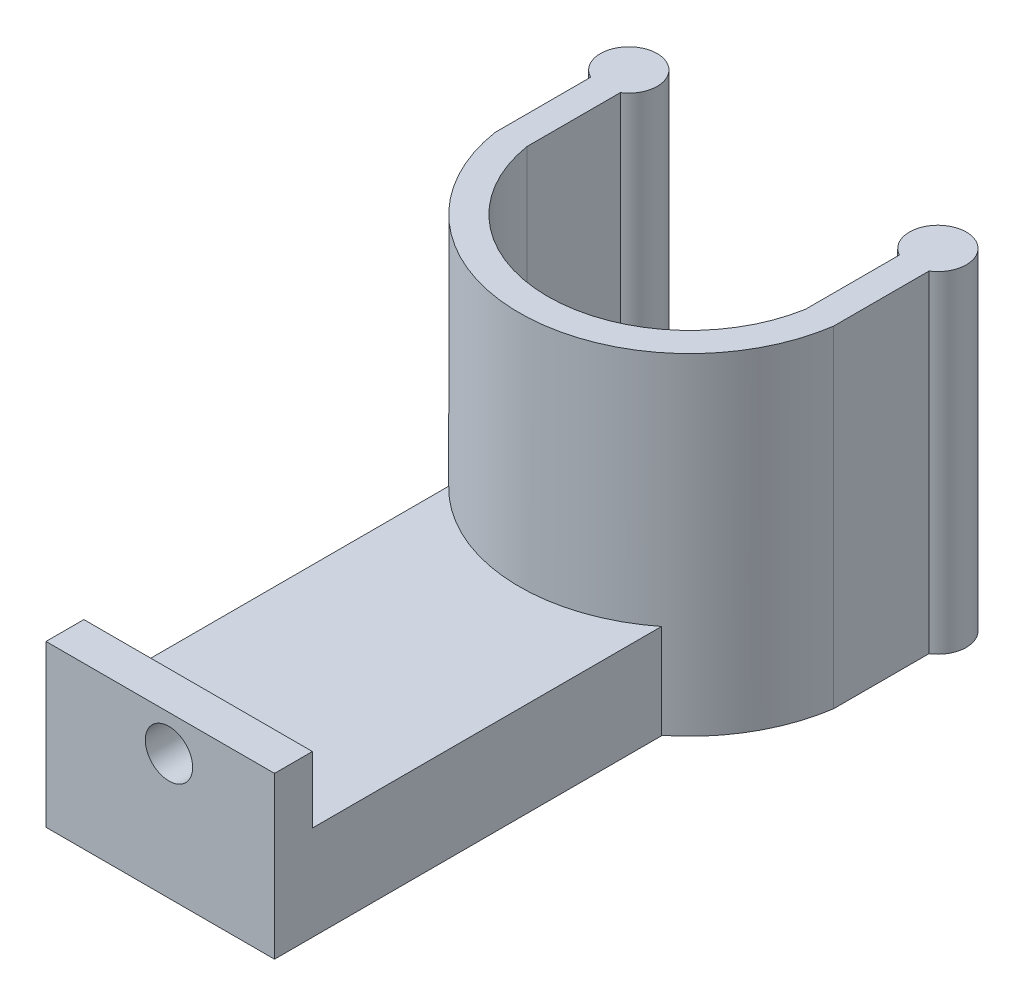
ISO-10303-21;
HEADER;
FILE_DESCRIPTION(('STEP AP214'),'2;1');
FILE_NAME('part.step','',(''),(''),'','','');
FILE_SCHEMA(('AUTOMOTIVE_DESIGN { 1 0 10303 214 1 1 1 1 }'));
ENDSEC;
DATA;
#1=APPLICATION_CONTEXT('core data for automotive mechanical design processes');
#2=APPLICATION_PROTOCOL_DEFINITION('international standard','automotive_design',2000,#1);
#3=PRODUCT_CONTEXT('',#1,'mechanical');
#4=PRODUCT('Part','Part','',(#3));
#5=PRODUCT_RELATED_PRODUCT_CATEGORY('part','',(#4));
#6=PRODUCT_DEFINITION_FORMATION('','',#4);
#7=PRODUCT_DEFINITION_CONTEXT('part definition',#1,'design');
#8=PRODUCT_DEFINITION('design','',#6,#7);
#9=PRODUCT_DEFINITION_SHAPE('','',#8);
#10=(LENGTH_UNIT() NAMED_UNIT(*) SI_UNIT(.MILLI.,.METRE.));
#11=(NAMED_UNIT(*) PLANE_ANGLE_UNIT() SI_UNIT($,.RADIAN.));
#12=(NAMED_UNIT(*) SI_UNIT($,.STERADIAN.) SOLID_ANGLE_UNIT());
#13=UNCERTAINTY_MEASURE_WITH_UNIT(LENGTH_MEASURE(1.E-05),#10,'distance_accuracy_value','');
#14=(GEOMETRIC_REPRESENTATION_CONTEXT(3) GLOBAL_UNCERTAINTY_ASSIGNED_CONTEXT((#13)) GLOBAL_UNIT_ASSIGNED_CONTEXT((#10,
#11,#12)) REPRESENTATION_CONTEXT('',''));
#15=CARTESIAN_POINT('',(0.,0.,0.));
#16=DIRECTION('',(0.,0.,1.));
#17=DIRECTION('',(1.,0.,0.));
#18=AXIS2_PLACEMENT_3D('',#15,#16,#17);
#19=CARTESIAN_POINT('',(16.2064052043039,35.,-10.0002773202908));
#20=DIRECTION('',(0.,-1.,0.));
#21=DIRECTION('',(0.,0.,-1.));
#22=AXIS2_PLACEMENT_3D('',#19,#20,#21);
#23=CYLINDRICAL_SURFACE('',#22,3.);
#24=CARTESIAN_POINT('',(16.2064052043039,0.,-10.0002773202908));
#25=DIRECTION('',(0.,1.,0.));
#26=DIRECTION('',(0.,0.,1.));
#27=AXIS2_PLACEMENT_3D('',#24,#25,#26);
#28=CIRCLE('',#27,3.);
#29=CARTESIAN_POINT('',(17.8074399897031,0.,-7.46321452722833));
#30=VERTEX_POINT('',#29);
#31=CARTESIAN_POINT('',(14.7811398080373,0.,-7.36046320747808));
#32=VERTEX_POINT('',#31);
#33=EDGE_CURVE('E234',#30,#32,#28,.T.);
#34=ORIENTED_EDGE('',*,*,#33,.T.);
#35=DIRECTION('',(0.,-1.,0.));
#36=VECTOR('',#35,1.);
#37=CARTESIAN_POINT('',(14.7811398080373,35.,-7.36046320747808));
#38=LINE('',#37,#36);
#39=CARTESIAN_POINT('',(14.7811398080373,35.,-7.36046320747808));
#40=VERTEX_POINT('',#39);
#41=EDGE_CURVE('E11',#40,#32,#38,.T.);
#42=ORIENTED_EDGE('',*,*,#41,.F.);
#43=CARTESIAN_POINT('',(16.2064052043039,35.,-10.0002773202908));
#44=DIRECTION('',(0.,1.,0.));
#45=DIRECTION('',(0.,0.,1.));
#46=AXIS2_PLACEMENT_3D('',#43,#44,#45);
#47=CIRCLE('',#46,3.);
#48=CARTESIAN_POINT('',(17.8074399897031,35.,-7.46321452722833));
#49=VERTEX_POINT('',#48);
#50=EDGE_CURVE('E253',#49,#40,#47,.T.);
#51=ORIENTED_EDGE('',*,*,#50,.F.);
#52=DIRECTION('',(0.,-1.,0.));
#53=VECTOR('',#52,1.);
#54=CARTESIAN_POINT('',(17.8074399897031,35.,-7.46321452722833));
#55=LINE('',#54,#53);
#56=EDGE_CURVE('E270',#49,#30,#55,.T.);
#57=ORIENTED_EDGE('',*,*,#56,.T.);
#58=EDGE_LOOP('',(#34,#42,#51,#57));
#59=FACE_BOUND('',#58,.T.);
#60=ADVANCED_FACE('F33',(#59),#23,.T.);
#61=CARTESIAN_POINT('',(14.7811398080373,35.,2.55301899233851));
#62=DIRECTION('',(1.,0.,0.));
#63=DIRECTION('',(0.,0.,-1.));
#64=AXIS2_PLACEMENT_3D('',#61,#62,#63);
#65=PLANE('',#64);
#66=DIRECTION('',(0.,0.,1.));
#67=VECTOR('',#66,1.);
#68=CARTESIAN_POINT('',(14.7811398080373,0.,2.55301899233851));
#69=LINE('',#68,#67);
#70=CARTESIAN_POINT('',(14.7811398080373,0.,2.55301899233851));
#71=VERTEX_POINT('',#70);
#72=EDGE_CURVE('E239',#32,#71,#69,.T.);
#73=ORIENTED_EDGE('',*,*,#72,.T.);
#74=DIRECTION('',(0.,-1.,0.));
#75=VECTOR('',#74,1.);
#76=CARTESIAN_POINT('',(14.7811398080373,35.,2.55301899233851));
#77=LINE('',#76,#75);
#78=CARTESIAN_POINT('',(14.7811398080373,35.,2.55301899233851));
#79=VERTEX_POINT('',#78);
#80=EDGE_CURVE('E42',#79,#71,#77,.T.);
#81=ORIENTED_EDGE('',*,*,#80,.F.);
#82=DIRECTION('',(0.,0.,1.));
#83=VECTOR('',#82,1.);
#84=CARTESIAN_POINT('',(14.7811398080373,35.,2.55301899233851));
#85=LINE('',#84,#83);
#86=EDGE_CURVE('E256',#40,#79,#85,.T.);
#87=ORIENTED_EDGE('',*,*,#86,.F.);
#88=ORIENTED_EDGE('',*,*,#41,.T.);
#89=EDGE_LOOP('',(#73,#81,#87,#88));
#90=FACE_BOUND('',#89,.T.);
#91=ADVANCED_FACE('F313',(#90),#65,.F.);
#92=CARTESIAN_POINT('',(0.,35.,0.));
#93=DIRECTION('',(0.,-1.,0.));
#94=DIRECTION('',(0.,0.,-1.));
#95=AXIS2_PLACEMENT_3D('',#92,#93,#94);
#96=CYLINDRICAL_SURFACE('',#95,14.9999999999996);
#97=CARTESIAN_POINT('',(0.,0.,0.));
#98=DIRECTION('',(0.,-1.,0.));
#99=DIRECTION('',(0.,0.,-1.));
#100=AXIS2_PLACEMENT_3D('',#97,#98,#99);
#101=CIRCLE('',#100,14.9999999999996);
#102=CARTESIAN_POINT('',(-14.8110947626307,0.,2.37307225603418));
#103=VERTEX_POINT('',#102);
#104=EDGE_CURVE('E273',#71,#103,#101,.T.);
#105=ORIENTED_EDGE('',*,*,#104,.T.);
#106=DIRECTION('',(0.,-1.,0.));
#107=VECTOR('',#106,1.);
#108=CARTESIAN_POINT('',(-14.8110947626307,35.,2.37307225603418));
#109=LINE('',#108,#107);
#110=CARTESIAN_POINT('',(-14.8110947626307,35.,2.37307225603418));
#111=VERTEX_POINT('',#110);
#112=EDGE_CURVE('E300',#111,#103,#109,.T.);
#113=ORIENTED_EDGE('',*,*,#112,.F.);
#114=CARTESIAN_POINT('',(0.,35.,0.));
#115=DIRECTION('',(0.,-1.,0.));
#116=DIRECTION('',(0.,0.,-1.));
#117=AXIS2_PLACEMENT_3D('',#114,#115,#116);
#118=CIRCLE('',#117,14.9999999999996);
#119=EDGE_CURVE('E259',#79,#111,#118,.T.);
#120=ORIENTED_EDGE('',*,*,#119,.F.);
#121=ORIENTED_EDGE('',*,*,#80,.T.);
#122=EDGE_LOOP('',(#105,#113,#120,#121));
#123=FACE_BOUND('',#122,.T.);
#124=ADVANCED_FACE('F318',(#123),#96,.F.);
#125=CARTESIAN_POINT('',(-14.8110947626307,35.,2.37307225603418));
#126=DIRECTION('',(-1.,0.,0.));
#127=DIRECTION('',(0.,0.,1.));
#128=AXIS2_PLACEMENT_3D('',#125,#126,#127);
#129=PLANE('',#128);
#130=DIRECTION('',(0.,0.,-1.));
#131=VECTOR('',#130,1.);
#132=CARTESIAN_POINT('',(-14.8110947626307,0.,2.37307225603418));
#133=LINE('',#132,#131);
#134=CARTESIAN_POINT('',(-14.8110947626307,0.,-7.47870757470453));
#135=VERTEX_POINT('',#134);
#136=EDGE_CURVE('E275',#103,#135,#133,.T.);
#137=ORIENTED_EDGE('',*,*,#136,.T.);
#138=DIRECTION('',(0.,-1.,0.));
#139=VECTOR('',#138,1.);
#140=CARTESIAN_POINT('',(-14.8110947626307,35.,-7.47870757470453));
#141=LINE('',#140,#139);
#142=CARTESIAN_POINT('',(-14.8110947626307,35.,-7.47870757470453));
#143=VERTEX_POINT('',#142);
#144=EDGE_CURVE('E297',#143,#135,#141,.T.);
#145=ORIENTED_EDGE('',*,*,#144,.F.);
#146=DIRECTION('',(0.,0.,-1.));
#147=VECTOR('',#146,1.);
#148=CARTESIAN_POINT('',(-14.8110947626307,35.,2.37307225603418));
#149=LINE('',#148,#147);
#150=EDGE_CURVE('E261',#111,#143,#149,.T.);
#151=ORIENTED_EDGE('',*,*,#150,.F.);
#152=ORIENTED_EDGE('',*,*,#112,.T.);
#153=EDGE_LOOP('',(#137,#145,#151,#152));
#154=FACE_BOUND('',#153,.T.);
#155=ADVANCED_FACE('F459',(#154),#129,.F.);
#156=CARTESIAN_POINT('',(-16.4364211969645,35.,-10.0002773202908));
#157=DIRECTION('',(0.,-1.,0.));
#158=DIRECTION('',(0.,0.,-1.));
#159=AXIS2_PLACEMENT_3D('',#156,#157,#158);
#160=CYLINDRICAL_SURFACE('',#159,3.);
#161=CARTESIAN_POINT('',(-16.4364211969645,0.,-10.0002773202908));
#162=DIRECTION('',(0.,1.,0.));
#163=DIRECTION('',(0.,0.,1.));
#164=AXIS2_PLACEMENT_3D('',#161,#162,#163);
#165=CIRCLE('',#164,3.);
#166=CARTESIAN_POINT('',(-17.7847017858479,0.,-7.32032593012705));
#167=VERTEX_POINT('',#166);
#168=EDGE_CURVE('E277',#135,#167,#165,.T.);
#169=ORIENTED_EDGE('',*,*,#168,.T.);
#170=DIRECTION('',(0.,-1.,0.));
#171=VECTOR('',#170,1.);
#172=CARTESIAN_POINT('',(-17.7847017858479,35.,-7.32032593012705));
#173=LINE('',#172,#171);
#174=CARTESIAN_POINT('',(-17.7847017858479,35.,-7.32032593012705));
#175=VERTEX_POINT('',#174);
#176=EDGE_CURVE('E294',#175,#167,#173,.T.);
#177=ORIENTED_EDGE('',*,*,#176,.F.);
#178=CARTESIAN_POINT('',(-16.4364211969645,35.,-10.0002773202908));
#179=DIRECTION('',(0.,1.,0.));
#180=DIRECTION('',(0.,0.,1.));
#181=AXIS2_PLACEMENT_3D('',#178,#179,#180);
#182=CIRCLE('',#181,3.);
#183=EDGE_CURVE('E263',#143,#175,#182,.T.);
#184=ORIENTED_EDGE('',*,*,#183,.F.);
#185=ORIENTED_EDGE('',*,*,#144,.T.);
#186=EDGE_LOOP('',(#169,#177,#184,#185));
#187=FACE_BOUND('',#186,.T.);
#188=ADVANCED_FACE('F451',(#187),#160,.T.);
#189=CARTESIAN_POINT('',(-17.7847017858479,35.,2.77567692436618));
#190=DIRECTION('',(1.,0.,0.));
#191=DIRECTION('',(0.,0.,-1.));
#192=AXIS2_PLACEMENT_3D('',#189,#190,#191);
#193=PLANE('',#192);
#194=DIRECTION('',(0.,0.,1.));
#195=VECTOR('',#194,1.);
#196=CARTESIAN_POINT('',(-17.7847017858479,0.,2.77567692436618));
#197=LINE('',#196,#195);
#198=CARTESIAN_POINT('',(-17.7847017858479,0.,2.77567692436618));
#199=VERTEX_POINT('',#198);
#200=EDGE_CURVE('E279',#167,#199,#197,.T.);
#201=ORIENTED_EDGE('',*,*,#200,.T.);
#202=DIRECTION('',(0.,-1.,0.));
#203=VECTOR('',#202,1.);
#204=CARTESIAN_POINT('',(-17.7847017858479,35.,2.77567692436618));
#205=LINE('',#204,#203);
#206=CARTESIAN_POINT('',(-17.7847017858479,35.,2.77567692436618));
#207=VERTEX_POINT('',#206);
#208=EDGE_CURVE('E291',#207,#199,#205,.T.);
#209=ORIENTED_EDGE('',*,*,#208,.F.);
#210=DIRECTION('',(0.,0.,1.));
#211=VECTOR('',#210,1.);
#212=CARTESIAN_POINT('',(-17.7847017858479,35.,2.77567692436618));
#213=LINE('',#212,#211);
#214=EDGE_CURVE('E265',#175,#207,#213,.T.);
#215=ORIENTED_EDGE('',*,*,#214,.F.);
#216=ORIENTED_EDGE('',*,*,#176,.T.);
#217=EDGE_LOOP('',(#201,#209,#215,#216));
#218=FACE_BOUND('',#217,.T.);
#219=ADVANCED_FACE('F445',(#218),#193,.F.);
#220=CARTESIAN_POINT('',(0.,35.,0.));
#221=DIRECTION('',(0.,-1.,0.));
#222=DIRECTION('',(0.,0.,-1.));
#223=AXIS2_PLACEMENT_3D('',#220,#221,#222);
#224=CYLINDRICAL_SURFACE('',#223,18.);
#225=CARTESIAN_POINT('',(0.,9.95595487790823,0.));
#226=DIRECTION('',(0.,1.,0.));
#227=DIRECTION('',(0.,0.,1.));
#228=AXIS2_PLACEMENT_3D('',#225,#226,#227);
#229=CIRCLE('',#228,18.);
#230=CARTESIAN_POINT('',(11.148821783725,9.95595487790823,14.1316585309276));
#231=VERTEX_POINT('',#230);
#232=CARTESIAN_POINT('',(-12.9213891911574,9.95595487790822,12.5314684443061));
#233=VERTEX_POINT('',#232);
#234=EDGE_CURVE('E50',#231,#233,#229,.F.);
#235=ORIENTED_EDGE('',*,*,#234,.F.);
#236=DIRECTION('',(0.,-1.,0.));
#237=VECTOR('',#236,1.);
#238=CARTESIAN_POINT('',(11.148821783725,35.,14.1316585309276));
#239=LINE('',#238,#237);
#240=CARTESIAN_POINT('',(11.148821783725,0.,14.1316585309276));
#241=VERTEX_POINT('',#240);
#242=EDGE_CURVE('E250',#241,#231,#239,.F.);
#243=ORIENTED_EDGE('',*,*,#242,.F.);
#244=CARTESIAN_POINT('',(0.,0.,0.));
#245=DIRECTION('',(0.,1.,0.));
#246=DIRECTION('',(0.,0.,-1.));
#247=AXIS2_PLACEMENT_3D('',#244,#245,#246);
#248=CIRCLE('',#247,18.);
#249=CARTESIAN_POINT('',(17.8074399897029,0.,2.62584862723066));
#250=VERTEX_POINT('',#249);
#251=EDGE_CURVE('E281',#241,#250,#248,.T.);
#252=ORIENTED_EDGE('',*,*,#251,.T.);
#253=DIRECTION('',(0.,-1.,0.));
#254=VECTOR('',#253,1.);
#255=CARTESIAN_POINT('',(17.8074399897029,35.,2.62584862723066));
#256=LINE('',#255,#254);
#257=CARTESIAN_POINT('',(17.8074399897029,35.,2.62584862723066));
#258=VERTEX_POINT('',#257);
#259=EDGE_CURVE('E288',#258,#250,#256,.T.);
#260=ORIENTED_EDGE('',*,*,#259,.F.);
#261=CARTESIAN_POINT('',(0.,35.,0.));
#262=DIRECTION('',(0.,1.,0.));
#263=DIRECTION('',(0.,0.,-1.));
#264=AXIS2_PLACEMENT_3D('',#261,#262,#263);
#265=CIRCLE('',#264,18.);
#266=EDGE_CURVE('E267',#207,#258,#265,.T.);
#267=ORIENTED_EDGE('',*,*,#266,.F.);
#268=ORIENTED_EDGE('',*,*,#208,.T.);
#269=CARTESIAN_POINT('',(-12.9213891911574,0.,12.5314684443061));
#270=VERTEX_POINT('',#269);
#271=EDGE_CURVE('E282',#199,#270,#248,.T.);
#272=ORIENTED_EDGE('',*,*,#271,.T.);
#273=DIRECTION('',(0.,-1.,0.));
#274=VECTOR('',#273,1.);
#275=CARTESIAN_POINT('',(-12.9213891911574,35.,12.5314684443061));
#276=LINE('',#275,#274);
#277=EDGE_CURVE('E55',#233,#270,#276,.T.);
#278=ORIENTED_EDGE('',*,*,#277,.F.);
#279=EDGE_LOOP('',(#235,#243,#252,#260,#267,#268,#272,#278));
#280=FACE_BOUND('',#279,.T.);
#281=ADVANCED_FACE('F338',(#280),#224,.T.);
#282=CARTESIAN_POINT('',(17.8074399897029,35.,2.62584862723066));
#283=DIRECTION('',(-1.,0.,0.));
#284=DIRECTION('',(0.,0.,1.));
#285=AXIS2_PLACEMENT_3D('',#282,#283,#284);
#286=PLANE('',#285);
#287=DIRECTION('',(0.,0.,-1.));
#288=VECTOR('',#287,1.);
#289=CARTESIAN_POINT('',(17.8074399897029,0.,2.62584862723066));
#290=LINE('',#289,#288);
#291=EDGE_CURVE('E257',#250,#30,#290,.T.);
#292=ORIENTED_EDGE('',*,*,#291,.T.);
#293=ORIENTED_EDGE('',*,*,#56,.F.);
#294=DIRECTION('',(0.,0.,-1.));
#295=VECTOR('',#294,1.);
#296=CARTESIAN_POINT('',(17.8074399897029,35.,2.62584862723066));
#297=LINE('',#296,#295);
#298=EDGE_CURVE('E269',#258,#49,#297,.T.);
#299=ORIENTED_EDGE('',*,*,#298,.F.);
#300=ORIENTED_EDGE('',*,*,#259,.T.);
#301=EDGE_LOOP('',(#292,#293,#299,#300));
#302=FACE_BOUND('',#301,.T.);
#303=ADVANCED_FACE('F337',(#302),#286,.F.);
#304=CARTESIAN_POINT('',(16.2064052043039,35.,-10.0002773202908));
#305=DIRECTION('',(0.,1.,0.));
#306=DIRECTION('',(0.,0.,1.));
#307=AXIS2_PLACEMENT_3D('',#304,#305,#306);
#308=PLANE('',#307);
#309=ORIENTED_EDGE('',*,*,#50,.T.);
#310=ORIENTED_EDGE('',*,*,#86,.T.);
#311=ORIENTED_EDGE('',*,*,#119,.T.);
#312=ORIENTED_EDGE('',*,*,#150,.T.);
#313=ORIENTED_EDGE('',*,*,#183,.T.);
#314=ORIENTED_EDGE('',*,*,#214,.T.);
#315=ORIENTED_EDGE('',*,*,#266,.T.);
#316=ORIENTED_EDGE('',*,*,#298,.T.);
#317=EDGE_LOOP('',(#309,#310,#311,#312,#313,#314,#315,#316));
#318=FACE_BOUND('',#317,.T.);
#319=ADVANCED_FACE('F332',(#318),#308,.T.);
#320=CARTESIAN_POINT('',(16.2064052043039,0.,-10.0002773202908));
#321=DIRECTION('',(0.,1.,0.));
#322=DIRECTION('',(0.,0.,1.));
#323=AXIS2_PLACEMENT_3D('',#320,#321,#322);
#324=PLANE('',#323);
#325=ORIENTED_EDGE('',*,*,#33,.F.);
#326=ORIENTED_EDGE('',*,*,#291,.F.);
#327=ORIENTED_EDGE('',*,*,#251,.F.);
#328=EDGE_CURVE('E284',#270,#241,#248,.T.);
#329=ORIENTED_EDGE('',*,*,#328,.F.);
#330=ORIENTED_EDGE('',*,*,#271,.F.);
#331=ORIENTED_EDGE('',*,*,#200,.F.);
#332=ORIENTED_EDGE('',*,*,#168,.F.);
#333=ORIENTED_EDGE('',*,*,#136,.F.);
#334=ORIENTED_EDGE('',*,*,#104,.F.);
#335=ORIENTED_EDGE('',*,*,#72,.F.);
#336=EDGE_LOOP('',(#325,#326,#327,#329,#330,#331,#332,#333,#334,#335));
#337=FACE_BOUND('',#336,.T.);
#338=ADVANCED_FACE('F326',(#337),#324,.F.);
#339=CARTESIAN_POINT('',(0.,35.,0.));
#340=DIRECTION('',(0.,-1.,0.));
#341=DIRECTION('',(0.,0.,-1.));
#342=AXIS2_PLACEMENT_3D('',#339,#340,#341);
#343=CYLINDRICAL_SURFACE('',#342,18.);
#344=ORIENTED_EDGE('',*,*,#328,.T.);
#345=CARTESIAN_POINT('',(11.148821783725,-0.0440451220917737,14.1316585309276));
#346=VERTEX_POINT('',#345);
#347=EDGE_CURVE('E247',#346,#241,#239,.F.);
#348=ORIENTED_EDGE('',*,*,#347,.F.);
#349=CARTESIAN_POINT('',(0.,-0.0440451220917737,0.));
#350=DIRECTION('',(0.,-1.,0.));
#351=DIRECTION('',(0.,0.,-1.));
#352=AXIS2_PLACEMENT_3D('',#349,#350,#351);
#353=CIRCLE('',#352,18.);
#354=CARTESIAN_POINT('',(-12.9213891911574,-0.0440451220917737,12.5314684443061));
#355=VERTEX_POINT('',#354);
#356=EDGE_CURVE('E222',#355,#346,#353,.F.);
#357=ORIENTED_EDGE('',*,*,#356,.F.);
#358=EDGE_CURVE('E241',#270,#355,#276,.T.);
#359=ORIENTED_EDGE('',*,*,#358,.F.);
#360=EDGE_LOOP('',(#344,#348,#357,#359));
#361=FACE_BOUND('',#360,.T.);
#362=ADVANCED_FACE('F342',(#361),#343,.F.);
#363=CARTESIAN_POINT('',(-12.9213891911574,-0.0440451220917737,-13.0012773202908));
#364=DIRECTION('',(0.,-1.,0.));
#365=DIRECTION('',(0.,0.,-1.));
#366=AXIS2_PLACEMENT_3D('',#363,#364,#365);
#367=PLANE('',#366);
#368=DIRECTION('',(0.,0.,1.));
#369=VECTOR('',#368,1.);
#370=CARTESIAN_POINT('',(-12.9213891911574,-0.0440451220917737,-13.0012773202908));
#371=LINE('',#370,#369);
#372=CARTESIAN_POINT('',(-12.9213891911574,-0.0440451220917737,50.9998405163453));
#373=VERTEX_POINT('',#372);
#374=EDGE_CURVE('E233',#355,#373,#371,.T.);
#375=ORIENTED_EDGE('',*,*,#374,.F.);
#376=ORIENTED_EDGE('',*,*,#356,.T.);
#377=DIRECTION('',(0.,0.,1.));
#378=VECTOR('',#377,1.);
#379=CARTESIAN_POINT('',(11.148821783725,-0.0440451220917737,-13.0012773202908));
#380=LINE('',#379,#378);
#381=CARTESIAN_POINT('',(11.148821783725,-0.0440451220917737,54.9998405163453));
#382=VERTEX_POINT('',#381);
#383=EDGE_CURVE('E225',#346,#382,#380,.T.);
#384=ORIENTED_EDGE('',*,*,#383,.T.);
#385=DIRECTION('',(1.,0.,0.));
#386=VECTOR('',#385,1.);
#387=CARTESIAN_POINT('',(11.148821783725,-0.0440451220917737,54.9998405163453));
#388=LINE('',#387,#386);
#389=CARTESIAN_POINT('',(-12.9860357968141,-0.0440451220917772,54.9998405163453));
#390=VERTEX_POINT('',#389);
#391=EDGE_CURVE('E165',#390,#382,#388,.T.);
#392=ORIENTED_EDGE('',*,*,#391,.F.);
#393=DIRECTION('',(0.,0.,-1.));
#394=VECTOR('',#393,1.);
#395=CARTESIAN_POINT('',(-12.9860357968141,-0.0440451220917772,54.9998405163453));
#396=LINE('',#395,#394);
#397=CARTESIAN_POINT('',(-12.9860357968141,-0.0440451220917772,50.9998405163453));
#398=VERTEX_POINT('',#397);
#399=EDGE_CURVE('E177',#390,#398,#396,.T.);
#400=ORIENTED_EDGE('',*,*,#399,.T.);
#401=DIRECTION('',(1.,0.,0.));
#402=VECTOR('',#401,1.);
#403=CARTESIAN_POINT('',(11.148821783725,-0.0440451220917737,50.9998405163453));
#404=LINE('',#403,#402);
#405=EDGE_CURVE('E168',#398,#373,#404,.T.);
#406=ORIENTED_EDGE('',*,*,#405,.T.);
#407=EDGE_LOOP('',(#375,#376,#384,#392,#400,#406));
#408=FACE_BOUND('',#407,.T.);
#409=ADVANCED_FACE('F345',(#408),#367,.T.);
#410=CARTESIAN_POINT('',(11.148821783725,9.95595487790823,-13.0012773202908));
#411=DIRECTION('',(1.,0.,0.));
#412=DIRECTION('',(0.,0.,-1.));
#413=AXIS2_PLACEMENT_3D('',#410,#411,#412);
#414=PLANE('',#413);
#415=ORIENTED_EDGE('',*,*,#383,.F.);
#416=ORIENTED_EDGE('',*,*,#347,.T.);
#417=ORIENTED_EDGE('',*,*,#242,.T.);
#418=DIRECTION('',(0.,0.,1.));
#419=VECTOR('',#418,1.);
#420=CARTESIAN_POINT('',(11.148821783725,9.95595487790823,-13.0012773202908));
#421=LINE('',#420,#419);
#422=CARTESIAN_POINT('',(11.148821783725,9.95595487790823,50.9998405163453));
#423=VERTEX_POINT('',#422);
#424=EDGE_CURVE('E246',#231,#423,#421,.T.);
#425=ORIENTED_EDGE('',*,*,#424,.T.);
#426=DIRECTION('',(0.,1.,0.));
#427=VECTOR('',#426,1.);
#428=CARTESIAN_POINT('',(11.148821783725,-0.0440451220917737,50.9998405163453));
#429=LINE('',#428,#427);
#430=CARTESIAN_POINT('',(11.148821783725,16.9559548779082,50.9998405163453));
#431=VERTEX_POINT('',#430);
#432=EDGE_CURVE('E172',#423,#431,#429,.T.);
#433=ORIENTED_EDGE('',*,*,#432,.T.);
#434=DIRECTION('',(0.,0.,-1.));
#435=VECTOR('',#434,1.);
#436=CARTESIAN_POINT('',(11.148821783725,16.9559548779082,54.9998405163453));
#437=LINE('',#436,#435);
#438=CARTESIAN_POINT('',(11.148821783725,16.9559548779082,54.9998405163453));
#439=VERTEX_POINT('',#438);
#440=EDGE_CURVE('E153',#439,#431,#437,.T.);
#441=ORIENTED_EDGE('',*,*,#440,.F.);
#442=DIRECTION('',(0.,1.,0.));
#443=VECTOR('',#442,1.);
#444=CARTESIAN_POINT('',(11.148821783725,-0.0440451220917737,54.9998405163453));
#445=LINE('',#444,#443);
#446=EDGE_CURVE('E159',#382,#439,#445,.T.);
#447=ORIENTED_EDGE('',*,*,#446,.F.);
#448=EDGE_LOOP('',(#415,#416,#417,#425,#433,#441,#447));
#449=FACE_BOUND('',#448,.T.);
#450=ADVANCED_FACE('F170',(#449),#414,.T.);
#451=CARTESIAN_POINT('',(-12.9213891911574,9.95595487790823,-13.0012773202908));
#452=DIRECTION('',(0.,1.,0.));
#453=DIRECTION('',(0.,0.,1.));
#454=AXIS2_PLACEMENT_3D('',#451,#452,#453);
#455=PLANE('',#454);
#456=ORIENTED_EDGE('',*,*,#424,.F.);
#457=ORIENTED_EDGE('',*,*,#234,.T.);
#458=DIRECTION('',(0.,0.,1.));
#459=VECTOR('',#458,1.);
#460=CARTESIAN_POINT('',(-12.9213891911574,9.95595487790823,-13.0012773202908));
#461=LINE('',#460,#459);
#462=CARTESIAN_POINT('',(-12.9213891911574,9.95595487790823,50.9998405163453));
#463=VERTEX_POINT('',#462);
#464=EDGE_CURVE('E243',#233,#463,#461,.T.);
#465=ORIENTED_EDGE('',*,*,#464,.T.);
#466=DIRECTION('',(-1.,0.,0.));
#467=VECTOR('',#466,1.);
#468=CARTESIAN_POINT('',(-12.9213891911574,9.95595487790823,50.9998405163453));
#469=LINE('',#468,#467);
#470=EDGE_CURVE('E176',#423,#463,#469,.T.);
#471=ORIENTED_EDGE('',*,*,#470,.F.);
#472=EDGE_LOOP('',(#456,#457,#465,#471));
#473=FACE_BOUND('',#472,.T.);
#474=ADVANCED_FACE('F304',(#473),#455,.T.);
#475=CARTESIAN_POINT('',(-12.9213891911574,9.95595487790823,-13.0012773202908));
#476=DIRECTION('',(-1.,0.,0.));
#477=DIRECTION('',(0.,-1.,0.));
#478=AXIS2_PLACEMENT_3D('',#475,#476,#477);
#479=PLANE('',#478);
#480=ORIENTED_EDGE('',*,*,#464,.F.);
#481=ORIENTED_EDGE('',*,*,#277,.T.);
#482=ORIENTED_EDGE('',*,*,#358,.T.);
#483=ORIENTED_EDGE('',*,*,#374,.T.);
#484=DIRECTION('',(0.,-1.,0.));
#485=VECTOR('',#484,1.);
#486=CARTESIAN_POINT('',(-12.9213891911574,9.95595487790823,50.9998405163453));
#487=LINE('',#486,#485);
#488=EDGE_CURVE('E36',#463,#373,#487,.T.);
#489=ORIENTED_EDGE('',*,*,#488,.F.);
#490=EDGE_LOOP('',(#480,#481,#482,#483,#489));
#491=FACE_BOUND('',#490,.T.);
#492=ADVANCED_FACE('F215',(#491),#479,.T.);
#493=CARTESIAN_POINT('',(0.,0.,50.9998405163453));
#494=DIRECTION('',(0.,0.,1.));
#495=DIRECTION('',(1.,0.,0.));
#496=AXIS2_PLACEMENT_3D('',#493,#494,#495);
#497=PLANE('',#496);
#498=CARTESIAN_POINT('',(0.,13.1828156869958,50.9998405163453));
#499=DIRECTION('',(0.,0.,-1.));
#500=DIRECTION('',(-1.,0.,0.));
#501=AXIS2_PLACEMENT_3D('',#498,#499,#500);
#502=CIRCLE('',#501,2.5);
#503=CARTESIAN_POINT('',(-2.5,13.1828156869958,50.9998405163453));
#504=VERTEX_POINT('',#503);
#505=EDGE_CURVE('E199',#504,#504,#502,.T.);
#506=ORIENTED_EDGE('',*,*,#505,.F.);
#507=EDGE_LOOP('',(#506));
#508=FACE_BOUND('',#507,.T.);
#509=ORIENTED_EDGE('',*,*,#470,.T.);
#510=ORIENTED_EDGE('',*,*,#488,.T.);
#511=ORIENTED_EDGE('',*,*,#405,.F.);
#512=DIRECTION('',(0.,-1.,0.));
#513=VECTOR('',#512,1.);
#514=CARTESIAN_POINT('',(-12.9860357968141,-0.0440451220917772,50.9998405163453));
#515=LINE('',#514,#513);
#516=CARTESIAN_POINT('',(-12.9860357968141,16.9559548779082,50.9998405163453));
#517=VERTEX_POINT('',#516);
#518=EDGE_CURVE('E191',#517,#398,#515,.T.);
#519=ORIENTED_EDGE('',*,*,#518,.F.);
#520=DIRECTION('',(-1.,0.,0.));
#521=VECTOR('',#520,1.);
#522=CARTESIAN_POINT('',(11.148821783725,16.9559548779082,50.9998405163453));
#523=LINE('',#522,#521);
#524=EDGE_CURVE('E183',#431,#517,#523,.T.);
#525=ORIENTED_EDGE('',*,*,#524,.F.);
#526=ORIENTED_EDGE('',*,*,#432,.F.);
#527=EDGE_LOOP('',(#509,#510,#511,#519,#525,#526));
#528=FACE_BOUND('',#527,.T.);
#529=ADVANCED_FACE('F212',(#508,#528),#497,.F.);
#530=CARTESIAN_POINT('',(11.148821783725,16.9559548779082,54.9998405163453));
#531=DIRECTION('',(0.,-1.,0.));
#532=DIRECTION('',(1.,0.,0.));
#533=AXIS2_PLACEMENT_3D('',#530,#531,#532);
#534=PLANE('',#533);
#535=ORIENTED_EDGE('',*,*,#524,.T.);
#536=DIRECTION('',(0.,0.,-1.));
#537=VECTOR('',#536,1.);
#538=CARTESIAN_POINT('',(-12.9860357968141,16.9559548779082,54.9998405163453));
#539=LINE('',#538,#537);
#540=CARTESIAN_POINT('',(-12.9860357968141,16.9559548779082,54.9998405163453));
#541=VERTEX_POINT('',#540);
#542=EDGE_CURVE('E155',#541,#517,#539,.T.);
#543=ORIENTED_EDGE('',*,*,#542,.F.);
#544=DIRECTION('',(-1.,0.,0.));
#545=VECTOR('',#544,1.);
#546=CARTESIAN_POINT('',(11.148821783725,16.9559548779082,54.9998405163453));
#547=LINE('',#546,#545);
#548=EDGE_CURVE('E149',#439,#541,#547,.T.);
#549=ORIENTED_EDGE('',*,*,#548,.F.);
#550=ORIENTED_EDGE('',*,*,#440,.T.);
#551=EDGE_LOOP('',(#535,#543,#549,#550));
#552=FACE_BOUND('',#551,.T.);
#553=ADVANCED_FACE('F151',(#552),#534,.F.);
#554=CARTESIAN_POINT('',(-12.9860357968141,-0.0440451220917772,54.9998405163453));
#555=DIRECTION('',(1.,0.,0.));
#556=DIRECTION('',(0.,0.,-1.));
#557=AXIS2_PLACEMENT_3D('',#554,#555,#556);
#558=PLANE('',#557);
#559=ORIENTED_EDGE('',*,*,#518,.T.);
#560=ORIENTED_EDGE('',*,*,#399,.F.);
#561=DIRECTION('',(0.,-1.,0.));
#562=VECTOR('',#561,1.);
#563=CARTESIAN_POINT('',(-12.9860357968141,-0.0440451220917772,54.9998405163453));
#564=LINE('',#563,#562);
#565=EDGE_CURVE('E158',#541,#390,#564,.T.);
#566=ORIENTED_EDGE('',*,*,#565,.F.);
#567=ORIENTED_EDGE('',*,*,#542,.T.);
#568=EDGE_LOOP('',(#559,#560,#566,#567));
#569=FACE_BOUND('',#568,.T.);
#570=ADVANCED_FACE('F348',(#569),#558,.F.);
#571=CARTESIAN_POINT('',(0.,0.,54.9998405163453));
#572=DIRECTION('',(0.,0.,1.));
#573=DIRECTION('',(1.,0.,0.));
#574=AXIS2_PLACEMENT_3D('',#571,#572,#573);
#575=PLANE('',#574);
#576=CARTESIAN_POINT('',(0.,13.1828156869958,54.9998405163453));
#577=DIRECTION('',(0.,0.,-1.));
#578=DIRECTION('',(-1.,0.,0.));
#579=AXIS2_PLACEMENT_3D('',#576,#577,#578);
#580=CIRCLE('',#579,2.5);
#581=CARTESIAN_POINT('',(-2.5,13.1828156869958,54.9998405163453));
#582=VERTEX_POINT('',#581);
#583=EDGE_CURVE('E184',#582,#582,#580,.T.);
#584=ORIENTED_EDGE('',*,*,#583,.T.);
#585=EDGE_LOOP('',(#584));
#586=FACE_BOUND('',#585,.T.);
#587=ORIENTED_EDGE('',*,*,#446,.T.);
#588=ORIENTED_EDGE('',*,*,#548,.T.);
#589=ORIENTED_EDGE('',*,*,#565,.T.);
#590=ORIENTED_EDGE('',*,*,#391,.T.);
#591=EDGE_LOOP('',(#587,#588,#589,#590));
#592=FACE_BOUND('',#591,.T.);
#593=ADVANCED_FACE('F163',(#586,#592),#575,.T.);
#594=CARTESIAN_POINT('',(0.,13.1828156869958,54.9998405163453));
#595=DIRECTION('',(0.,0.,-1.));
#596=DIRECTION('',(-1.,0.,0.));
#597=AXIS2_PLACEMENT_3D('',#594,#595,#596);
#598=CYLINDRICAL_SURFACE('',#597,2.5);
#599=ORIENTED_EDGE('',*,*,#583,.F.);
#600=EDGE_LOOP('',(#599));
#601=FACE_BOUND('',#600,.T.);
#602=ORIENTED_EDGE('',*,*,#505,.T.);
#603=EDGE_LOOP('',(#602));
#604=FACE_BOUND('',#603,.T.);
#605=ADVANCED_FACE('F206',(#601,#604),#598,.F.);
#606=CLOSED_SHELL('',(#60,#91,#124,#155,#188,#219,#281,#303,#319,#338,#362,#409,#450,#474,#492,
#529,#553,#570,#593,#605));
#607=MANIFOLD_SOLID_BREP('B2',#606);
#608=ADVANCED_BREP_SHAPE_REPRESENTATION('',(#18,#607),#14);
#609=SHAPE_DEFINITION_REPRESENTATION(#9,#608);
ENDSEC;
END-ISO-10303-21;
